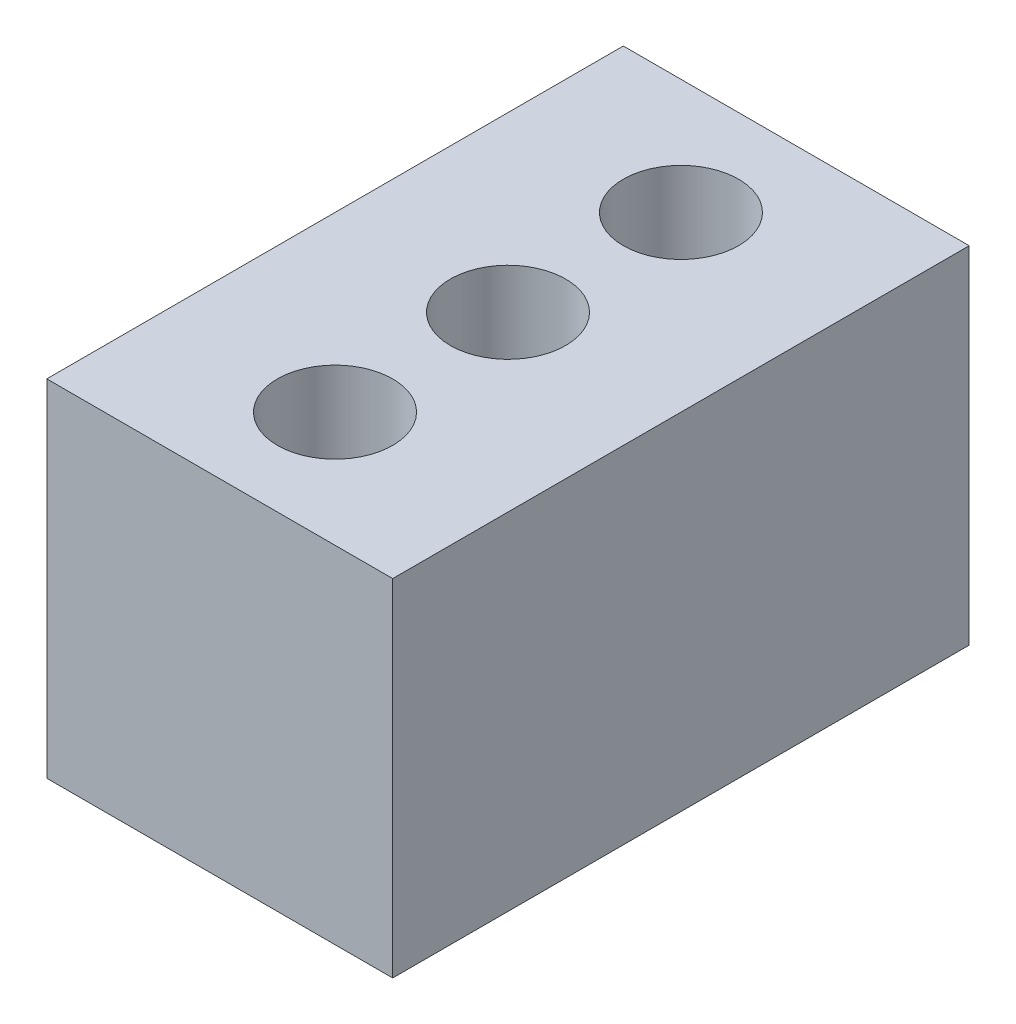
ISO-10303-21;
HEADER;
FILE_DESCRIPTION(('STEP AP214'),'2;1');
FILE_NAME('part.step','',(''),(''),'','','');
FILE_SCHEMA(('AUTOMOTIVE_DESIGN { 1 0 10303 214 1 1 1 1 }'));
ENDSEC;
DATA;
#1=APPLICATION_CONTEXT('core data for automotive mechanical design processes');
#2=APPLICATION_PROTOCOL_DEFINITION('international standard','automotive_design',2000,#1);
#3=PRODUCT_CONTEXT('',#1,'mechanical');
#4=PRODUCT('Part','Part','',(#3));
#5=PRODUCT_RELATED_PRODUCT_CATEGORY('part','',(#4));
#6=PRODUCT_DEFINITION_FORMATION('','',#4);
#7=PRODUCT_DEFINITION_CONTEXT('part definition',#1,'design');
#8=PRODUCT_DEFINITION('design','',#6,#7);
#9=PRODUCT_DEFINITION_SHAPE('','',#8);
#10=(LENGTH_UNIT() NAMED_UNIT(*) SI_UNIT(.MILLI.,.METRE.));
#11=(NAMED_UNIT(*) PLANE_ANGLE_UNIT() SI_UNIT($,.RADIAN.));
#12=(NAMED_UNIT(*) SI_UNIT($,.STERADIAN.) SOLID_ANGLE_UNIT());
#13=UNCERTAINTY_MEASURE_WITH_UNIT(LENGTH_MEASURE(1.E-05),#10,'distance_accuracy_value','');
#14=(GEOMETRIC_REPRESENTATION_CONTEXT(3) GLOBAL_UNCERTAINTY_ASSIGNED_CONTEXT((#13)) GLOBAL_UNIT_ASSIGNED_CONTEXT((#10,
#11,#12)) REPRESENTATION_CONTEXT('',''));
#15=CARTESIAN_POINT('',(0.,0.,0.));
#16=DIRECTION('',(0.,0.,1.));
#17=DIRECTION('',(1.,0.,0.));
#18=AXIS2_PLACEMENT_3D('',#15,#16,#17);
#19=CARTESIAN_POINT('',(0.,0.,50.));
#20=DIRECTION('',(1.,0.,0.));
#21=DIRECTION('',(0.,1.,0.));
#22=AXIS2_PLACEMENT_3D('',#19,#20,#21);
#23=PLANE('',#22);
#24=DIRECTION('',(0.,-1.,0.));
#25=VECTOR('',#24,1.);
#26=CARTESIAN_POINT('',(0.,0.,0.));
#27=LINE('',#26,#25);
#28=CARTESIAN_POINT('',(0.,0.,0.));
#29=VERTEX_POINT('',#28);
#30=CARTESIAN_POINT('',(0.,-30.,0.));
#31=VERTEX_POINT('',#30);
#32=EDGE_CURVE('E140',#29,#31,#27,.T.);
#33=ORIENTED_EDGE('',*,*,#32,.T.);
#34=DIRECTION('',(0.,0.,-1.));
#35=VECTOR('',#34,1.);
#36=CARTESIAN_POINT('',(0.,-30.,50.));
#37=LINE('',#36,#35);
#38=CARTESIAN_POINT('',(0.,-30.,50.));
#39=VERTEX_POINT('',#38);
#40=EDGE_CURVE('E159',#39,#31,#37,.T.);
#41=ORIENTED_EDGE('',*,*,#40,.F.);
#42=DIRECTION('',(0.,-1.,0.));
#43=VECTOR('',#42,1.);
#44=CARTESIAN_POINT('',(0.,0.,50.));
#45=LINE('',#44,#43);
#46=CARTESIAN_POINT('',(0.,0.,50.));
#47=VERTEX_POINT('',#46);
#48=EDGE_CURVE('E141',#47,#39,#45,.T.);
#49=ORIENTED_EDGE('',*,*,#48,.F.);
#50=DIRECTION('',(0.,0.,-1.));
#51=VECTOR('',#50,1.);
#52=CARTESIAN_POINT('',(0.,0.,50.));
#53=LINE('',#52,#51);
#54=EDGE_CURVE('E147',#47,#29,#53,.T.);
#55=ORIENTED_EDGE('',*,*,#54,.T.);
#56=EDGE_LOOP('',(#33,#41,#49,#55));
#57=FACE_BOUND('',#56,.T.);
#58=ADVANCED_FACE('F34',(#57),#23,.F.);
#59=CARTESIAN_POINT('',(0.,-30.,50.));
#60=DIRECTION('',(0.,1.,0.));
#61=DIRECTION('',(0.,0.,1.));
#62=AXIS2_PLACEMENT_3D('',#59,#60,#61);
#63=PLANE('',#62);
#64=CARTESIAN_POINT('',(15.,-30.,25.));
#65=DIRECTION('',(0.,1.,0.));
#66=DIRECTION('',(0.,0.,1.));
#67=AXIS2_PLACEMENT_3D('',#64,#65,#66);
#68=CIRCLE('',#67,4.99999999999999);
#69=CARTESIAN_POINT('',(15.,-30.,30.));
#70=VERTEX_POINT('',#69);
#71=EDGE_CURVE('E113',#70,#70,#68,.T.);
#72=ORIENTED_EDGE('',*,*,#71,.T.);
#73=EDGE_LOOP('',(#72));
#74=FACE_BOUND('',#73,.T.);
#75=CARTESIAN_POINT('',(15.,-30.,40.));
#76=DIRECTION('',(0.,1.,0.));
#77=DIRECTION('',(0.,0.,1.));
#78=AXIS2_PLACEMENT_3D('',#75,#76,#77);
#79=CIRCLE('',#78,4.99999999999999);
#80=CARTESIAN_POINT('',(15.,-30.,45.));
#81=VERTEX_POINT('',#80);
#82=EDGE_CURVE('E134',#81,#81,#79,.T.);
#83=ORIENTED_EDGE('',*,*,#82,.T.);
#84=EDGE_LOOP('',(#83));
#85=FACE_BOUND('',#84,.T.);
#86=DIRECTION('',(1.,0.,0.));
#87=VECTOR('',#86,1.);
#88=CARTESIAN_POINT('',(0.,-30.,0.));
#89=LINE('',#88,#87);
#90=CARTESIAN_POINT('',(30.,-30.,0.));
#91=VERTEX_POINT('',#90);
#92=EDGE_CURVE('E150',#31,#91,#89,.T.);
#93=ORIENTED_EDGE('',*,*,#92,.T.);
#94=DIRECTION('',(0.,0.,-1.));
#95=VECTOR('',#94,1.);
#96=CARTESIAN_POINT('',(30.,-30.,50.));
#97=LINE('',#96,#95);
#98=CARTESIAN_POINT('',(30.,-30.,50.));
#99=VERTEX_POINT('',#98);
#100=EDGE_CURVE('E157',#99,#91,#97,.T.);
#101=ORIENTED_EDGE('',*,*,#100,.F.);
#102=DIRECTION('',(1.,0.,0.));
#103=VECTOR('',#102,1.);
#104=CARTESIAN_POINT('',(0.,-30.,50.));
#105=LINE('',#104,#103);
#106=EDGE_CURVE('E83',#39,#99,#105,.T.);
#107=ORIENTED_EDGE('',*,*,#106,.F.);
#108=ORIENTED_EDGE('',*,*,#40,.T.);
#109=EDGE_LOOP('',(#93,#101,#107,#108));
#110=FACE_BOUND('',#109,.T.);
#111=CARTESIAN_POINT('',(15.,-30.,10.));
#112=DIRECTION('',(0.,1.,0.));
#113=DIRECTION('',(0.,0.,1.));
#114=AXIS2_PLACEMENT_3D('',#111,#112,#113);
#115=CIRCLE('',#114,4.99999999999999);
#116=CARTESIAN_POINT('',(15.,-30.,15.));
#117=VERTEX_POINT('',#116);
#118=EDGE_CURVE('E43',#117,#117,#115,.T.);
#119=ORIENTED_EDGE('',*,*,#118,.T.);
#120=EDGE_LOOP('',(#119));
#121=FACE_BOUND('',#120,.T.);
#122=ADVANCED_FACE('F163',(#74,#85,#110,#121),#63,.F.);
#123=CARTESIAN_POINT('',(30.,0.,50.));
#124=DIRECTION('',(-1.,0.,0.));
#125=DIRECTION('',(0.,-1.,0.));
#126=AXIS2_PLACEMENT_3D('',#123,#124,#125);
#127=PLANE('',#126);
#128=DIRECTION('',(0.,1.,0.));
#129=VECTOR('',#128,1.);
#130=CARTESIAN_POINT('',(30.,0.,0.));
#131=LINE('',#130,#129);
#132=CARTESIAN_POINT('',(30.,0.,0.));
#133=VERTEX_POINT('',#132);
#134=EDGE_CURVE('E69',#91,#133,#131,.T.);
#135=ORIENTED_EDGE('',*,*,#134,.T.);
#136=DIRECTION('',(0.,0.,-1.));
#137=VECTOR('',#136,1.);
#138=CARTESIAN_POINT('',(30.,0.,50.));
#139=LINE('',#138,#137);
#140=CARTESIAN_POINT('',(30.,0.,50.));
#141=VERTEX_POINT('',#140);
#142=EDGE_CURVE('E155',#141,#133,#139,.T.);
#143=ORIENTED_EDGE('',*,*,#142,.F.);
#144=DIRECTION('',(0.,1.,0.));
#145=VECTOR('',#144,1.);
#146=CARTESIAN_POINT('',(30.,0.,50.));
#147=LINE('',#146,#145);
#148=EDGE_CURVE('E144',#99,#141,#147,.T.);
#149=ORIENTED_EDGE('',*,*,#148,.F.);
#150=ORIENTED_EDGE('',*,*,#100,.T.);
#151=EDGE_LOOP('',(#135,#143,#149,#150));
#152=FACE_BOUND('',#151,.T.);
#153=ADVANCED_FACE('F172',(#152),#127,.F.);
#154=CARTESIAN_POINT('',(0.,0.,50.));
#155=DIRECTION('',(0.,-1.,0.));
#156=DIRECTION('',(0.,0.,-1.));
#157=AXIS2_PLACEMENT_3D('',#154,#155,#156);
#158=PLANE('',#157);
#159=CARTESIAN_POINT('',(15.,0.,25.));
#160=DIRECTION('',(0.,1.,0.));
#161=DIRECTION('',(0.,0.,1.));
#162=AXIS2_PLACEMENT_3D('',#159,#160,#161);
#163=CIRCLE('',#162,5.);
#164=CARTESIAN_POINT('',(15.,0.,30.));
#165=VERTEX_POINT('',#164);
#166=EDGE_CURVE('E107',#165,#165,#163,.T.);
#167=ORIENTED_EDGE('',*,*,#166,.F.);
#168=EDGE_LOOP('',(#167));
#169=FACE_BOUND('',#168,.T.);
#170=CARTESIAN_POINT('',(15.,0.,40.));
#171=DIRECTION('',(0.,1.,0.));
#172=DIRECTION('',(0.,0.,1.));
#173=AXIS2_PLACEMENT_3D('',#170,#171,#172);
#174=CIRCLE('',#173,5.);
#175=CARTESIAN_POINT('',(15.,0.,45.));
#176=VERTEX_POINT('',#175);
#177=EDGE_CURVE('E137',#176,#176,#174,.T.);
#178=ORIENTED_EDGE('',*,*,#177,.F.);
#179=EDGE_LOOP('',(#178));
#180=FACE_BOUND('',#179,.T.);
#181=DIRECTION('',(-1.,0.,0.));
#182=VECTOR('',#181,1.);
#183=CARTESIAN_POINT('',(0.,0.,0.));
#184=LINE('',#183,#182);
#185=EDGE_CURVE('E75',#133,#29,#184,.T.);
#186=ORIENTED_EDGE('',*,*,#185,.T.);
#187=ORIENTED_EDGE('',*,*,#54,.F.);
#188=DIRECTION('',(-1.,0.,0.));
#189=VECTOR('',#188,1.);
#190=CARTESIAN_POINT('',(0.,0.,50.));
#191=LINE('',#190,#189);
#192=EDGE_CURVE('E51',#141,#47,#191,.T.);
#193=ORIENTED_EDGE('',*,*,#192,.F.);
#194=ORIENTED_EDGE('',*,*,#142,.T.);
#195=EDGE_LOOP('',(#186,#187,#193,#194));
#196=FACE_BOUND('',#195,.T.);
#197=CARTESIAN_POINT('',(15.,0.,10.));
#198=DIRECTION('',(0.,1.,0.));
#199=DIRECTION('',(0.,0.,1.));
#200=AXIS2_PLACEMENT_3D('',#197,#198,#199);
#201=CIRCLE('',#200,5.);
#202=CARTESIAN_POINT('',(15.,0.,15.));
#203=VERTEX_POINT('',#202);
#204=EDGE_CURVE('E11',#203,#203,#201,.T.);
#205=ORIENTED_EDGE('',*,*,#204,.F.);
#206=EDGE_LOOP('',(#205));
#207=FACE_BOUND('',#206,.T.);
#208=ADVANCED_FACE('F169',(#169,#180,#196,#207),#158,.F.);
#209=CARTESIAN_POINT('',(0.,-30.,50.));
#210=DIRECTION('',(0.,0.,1.));
#211=DIRECTION('',(1.,0.,0.));
#212=AXIS2_PLACEMENT_3D('',#209,#210,#211);
#213=PLANE('',#212);
#214=ORIENTED_EDGE('',*,*,#48,.T.);
#215=ORIENTED_EDGE('',*,*,#106,.T.);
#216=ORIENTED_EDGE('',*,*,#148,.T.);
#217=ORIENTED_EDGE('',*,*,#192,.T.);
#218=EDGE_LOOP('',(#214,#215,#216,#217));
#219=FACE_BOUND('',#218,.T.);
#220=ADVANCED_FACE('F171',(#219),#213,.T.);
#221=CARTESIAN_POINT('',(0.,-30.,0.));
#222=DIRECTION('',(0.,0.,1.));
#223=DIRECTION('',(1.,0.,0.));
#224=AXIS2_PLACEMENT_3D('',#221,#222,#223);
#225=PLANE('',#224);
#226=CARTESIAN_POINT('',(24.,-24.,0.));
#227=DIRECTION('',(0.,0.,-1.));
#228=DIRECTION('',(-1.,0.,0.));
#229=AXIS2_PLACEMENT_3D('',#226,#227,#228);
#230=CIRCLE('',#229,2.5);
#231=CARTESIAN_POINT('',(21.5,-24.,0.));
#232=VERTEX_POINT('',#231);
#233=EDGE_CURVE('E106',#232,#232,#230,.T.);
#234=ORIENTED_EDGE('',*,*,#233,.F.);
#235=EDGE_LOOP('',(#234));
#236=FACE_BOUND('',#235,.T.);
#237=CARTESIAN_POINT('',(6.,-24.,0.));
#238=DIRECTION('',(0.,0.,-1.));
#239=DIRECTION('',(-1.,0.,0.));
#240=AXIS2_PLACEMENT_3D('',#237,#238,#239);
#241=CIRCLE('',#240,2.5);
#242=CARTESIAN_POINT('',(3.5,-24.,0.));
#243=VERTEX_POINT('',#242);
#244=EDGE_CURVE('E119',#243,#243,#241,.T.);
#245=ORIENTED_EDGE('',*,*,#244,.F.);
#246=EDGE_LOOP('',(#245));
#247=FACE_BOUND('',#246,.T.);
#248=CARTESIAN_POINT('',(24.,-6.,0.));
#249=DIRECTION('',(0.,0.,-1.));
#250=DIRECTION('',(-1.,0.,0.));
#251=AXIS2_PLACEMENT_3D('',#248,#249,#250);
#252=CIRCLE('',#251,2.5);
#253=CARTESIAN_POINT('',(21.5,-6.,0.));
#254=VERTEX_POINT('',#253);
#255=EDGE_CURVE('E122',#254,#254,#252,.T.);
#256=ORIENTED_EDGE('',*,*,#255,.F.);
#257=EDGE_LOOP('',(#256));
#258=FACE_BOUND('',#257,.T.);
#259=CARTESIAN_POINT('',(6.,-6.,0.));
#260=DIRECTION('',(0.,0.,-1.));
#261=DIRECTION('',(-1.,0.,0.));
#262=AXIS2_PLACEMENT_3D('',#259,#260,#261);
#263=CIRCLE('',#262,2.5);
#264=CARTESIAN_POINT('',(3.5,-6.,0.));
#265=VERTEX_POINT('',#264);
#266=EDGE_CURVE('E131',#265,#265,#263,.T.);
#267=ORIENTED_EDGE('',*,*,#266,.F.);
#268=EDGE_LOOP('',(#267));
#269=FACE_BOUND('',#268,.T.);
#270=ORIENTED_EDGE('',*,*,#32,.F.);
#271=ORIENTED_EDGE('',*,*,#185,.F.);
#272=ORIENTED_EDGE('',*,*,#134,.F.);
#273=ORIENTED_EDGE('',*,*,#92,.F.);
#274=EDGE_LOOP('',(#270,#271,#272,#273));
#275=FACE_BOUND('',#274,.T.);
#276=ADVANCED_FACE('F179',(#236,#247,#258,#269,#275),#225,.F.);
#277=CARTESIAN_POINT('',(15.,0.,40.));
#278=DIRECTION('',(0.,1.,0.));
#279=DIRECTION('',(0.,0.,1.));
#280=AXIS2_PLACEMENT_3D('',#277,#278,#279);
#281=CYLINDRICAL_SURFACE('',#280,5.);
#282=ORIENTED_EDGE('',*,*,#82,.F.);
#283=EDGE_LOOP('',(#282));
#284=FACE_BOUND('',#283,.T.);
#285=ORIENTED_EDGE('',*,*,#177,.T.);
#286=EDGE_LOOP('',(#285));
#287=FACE_BOUND('',#286,.T.);
#288=ADVANCED_FACE('F198',(#284,#287),#281,.F.);
#289=CARTESIAN_POINT('',(6.,-6.,0.));
#290=DIRECTION('',(0.,0.,-1.));
#291=DIRECTION('',(-1.,0.,0.));
#292=AXIS2_PLACEMENT_3D('',#289,#290,#291);
#293=CYLINDRICAL_SURFACE('',#292,2.5);
#294=CARTESIAN_POINT('',(6.,-6.,13.));
#295=DIRECTION('',(0.,0.,-1.));
#296=DIRECTION('',(-1.,0.,0.));
#297=AXIS2_PLACEMENT_3D('',#294,#295,#296);
#298=CIRCLE('',#297,2.5);
#299=CARTESIAN_POINT('',(3.5,-6.,13.));
#300=VERTEX_POINT('',#299);
#301=EDGE_CURVE('E128',#300,#300,#298,.T.);
#302=ORIENTED_EDGE('',*,*,#301,.F.);
#303=EDGE_LOOP('',(#302));
#304=FACE_BOUND('',#303,.T.);
#305=ORIENTED_EDGE('',*,*,#266,.T.);
#306=EDGE_LOOP('',(#305));
#307=FACE_BOUND('',#306,.T.);
#308=ADVANCED_FACE('F203',(#304,#307),#293,.F.);
#309=CARTESIAN_POINT('',(6.,-6.,13.));
#310=DIRECTION('',(0.,0.,-1.));
#311=DIRECTION('',(-1.,0.,0.));
#312=AXIS2_PLACEMENT_3D('',#309,#310,#311);
#313=CONICAL_SURFACE('',#312,2.5,1.02974425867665);
#314=CARTESIAN_POINT('',(5.99999999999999,-6.,14.5021515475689));
#315=VERTEX_POINT('',#314);
#316=VERTEX_LOOP('',#315);
#317=FACE_BOUND('',#316,.T.);
#318=ORIENTED_EDGE('',*,*,#301,.T.);
#319=EDGE_LOOP('',(#318));
#320=FACE_BOUND('',#319,.T.);
#321=ADVANCED_FACE('F211',(#317,#320),#313,.F.);
#322=CARTESIAN_POINT('',(24.,-6.,0.));
#323=DIRECTION('',(0.,0.,-1.));
#324=DIRECTION('',(-1.,0.,0.));
#325=AXIS2_PLACEMENT_3D('',#322,#323,#324);
#326=CYLINDRICAL_SURFACE('',#325,2.5);
#327=CARTESIAN_POINT('',(24.,-6.,13.));
#328=DIRECTION('',(0.,0.,-1.));
#329=DIRECTION('',(-1.,0.,0.));
#330=AXIS2_PLACEMENT_3D('',#327,#328,#329);
#331=CIRCLE('',#330,2.5);
#332=CARTESIAN_POINT('',(21.5,-6.,13.));
#333=VERTEX_POINT('',#332);
#334=EDGE_CURVE('E125',#333,#333,#331,.T.);
#335=ORIENTED_EDGE('',*,*,#334,.F.);
#336=EDGE_LOOP('',(#335));
#337=FACE_BOUND('',#336,.T.);
#338=ORIENTED_EDGE('',*,*,#255,.T.);
#339=EDGE_LOOP('',(#338));
#340=FACE_BOUND('',#339,.T.);
#341=ADVANCED_FACE('F215',(#337,#340),#326,.F.);
#342=CARTESIAN_POINT('',(24.,-6.,13.));
#343=DIRECTION('',(0.,0.,-1.));
#344=DIRECTION('',(-1.,0.,0.));
#345=AXIS2_PLACEMENT_3D('',#342,#343,#344);
#346=CONICAL_SURFACE('',#345,2.5,1.02974425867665);
#347=CARTESIAN_POINT('',(24.,-6.,14.5021515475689));
#348=VERTEX_POINT('',#347);
#349=VERTEX_LOOP('',#348);
#350=FACE_BOUND('',#349,.T.);
#351=ORIENTED_EDGE('',*,*,#334,.T.);
#352=EDGE_LOOP('',(#351));
#353=FACE_BOUND('',#352,.T.);
#354=ADVANCED_FACE('F217',(#350,#353),#346,.F.);
#355=CARTESIAN_POINT('',(6.,-24.,0.));
#356=DIRECTION('',(0.,0.,-1.));
#357=DIRECTION('',(-1.,0.,0.));
#358=AXIS2_PLACEMENT_3D('',#355,#356,#357);
#359=CYLINDRICAL_SURFACE('',#358,2.5);
#360=CARTESIAN_POINT('',(6.,-24.,13.));
#361=DIRECTION('',(0.,0.,-1.));
#362=DIRECTION('',(-1.,0.,0.));
#363=AXIS2_PLACEMENT_3D('',#360,#361,#362);
#364=CIRCLE('',#363,2.5);
#365=CARTESIAN_POINT('',(3.5,-24.,13.));
#366=VERTEX_POINT('',#365);
#367=EDGE_CURVE('E110',#366,#366,#364,.T.);
#368=ORIENTED_EDGE('',*,*,#367,.F.);
#369=EDGE_LOOP('',(#368));
#370=FACE_BOUND('',#369,.T.);
#371=ORIENTED_EDGE('',*,*,#244,.T.);
#372=EDGE_LOOP('',(#371));
#373=FACE_BOUND('',#372,.T.);
#374=ADVANCED_FACE('F221',(#370,#373),#359,.F.);
#375=CARTESIAN_POINT('',(6.,-24.,13.));
#376=DIRECTION('',(0.,0.,-1.));
#377=DIRECTION('',(-1.,0.,0.));
#378=AXIS2_PLACEMENT_3D('',#375,#376,#377);
#379=CONICAL_SURFACE('',#378,2.5,1.02974425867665);
#380=CARTESIAN_POINT('',(6.,-24.,14.5021515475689));
#381=VERTEX_POINT('',#380);
#382=VERTEX_LOOP('',#381);
#383=FACE_BOUND('',#382,.T.);
#384=ORIENTED_EDGE('',*,*,#367,.T.);
#385=EDGE_LOOP('',(#384));
#386=FACE_BOUND('',#385,.T.);
#387=ADVANCED_FACE('F227',(#383,#386),#379,.F.);
#388=CARTESIAN_POINT('',(24.,-24.,0.));
#389=DIRECTION('',(0.,0.,-1.));
#390=DIRECTION('',(-1.,0.,0.));
#391=AXIS2_PLACEMENT_3D('',#388,#389,#390);
#392=CYLINDRICAL_SURFACE('',#391,2.5);
#393=CARTESIAN_POINT('',(24.,-24.,13.));
#394=DIRECTION('',(0.,0.,-1.));
#395=DIRECTION('',(-1.,0.,0.));
#396=AXIS2_PLACEMENT_3D('',#393,#394,#395);
#397=CIRCLE('',#396,2.5);
#398=CARTESIAN_POINT('',(21.5,-24.,13.));
#399=VERTEX_POINT('',#398);
#400=EDGE_CURVE('E104',#399,#399,#397,.T.);
#401=ORIENTED_EDGE('',*,*,#400,.F.);
#402=EDGE_LOOP('',(#401));
#403=FACE_BOUND('',#402,.T.);
#404=ORIENTED_EDGE('',*,*,#233,.T.);
#405=EDGE_LOOP('',(#404));
#406=FACE_BOUND('',#405,.T.);
#407=ADVANCED_FACE('F100',(#403,#406),#392,.F.);
#408=CARTESIAN_POINT('',(24.,-24.,13.));
#409=DIRECTION('',(0.,0.,-1.));
#410=DIRECTION('',(-1.,0.,0.));
#411=AXIS2_PLACEMENT_3D('',#408,#409,#410);
#412=CONICAL_SURFACE('',#411,2.5,1.02974425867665);
#413=CARTESIAN_POINT('',(24.,-24.,14.5021515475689));
#414=VERTEX_POINT('',#413);
#415=VERTEX_LOOP('',#414);
#416=FACE_BOUND('',#415,.T.);
#417=ORIENTED_EDGE('',*,*,#400,.T.);
#418=EDGE_LOOP('',(#417));
#419=FACE_BOUND('',#418,.T.);
#420=ADVANCED_FACE('F96',(#416,#419),#412,.F.);
#421=CARTESIAN_POINT('',(15.,0.,25.));
#422=DIRECTION('',(0.,1.,0.));
#423=DIRECTION('',(0.,0.,1.));
#424=AXIS2_PLACEMENT_3D('',#421,#422,#423);
#425=CYLINDRICAL_SURFACE('',#424,5.);
#426=ORIENTED_EDGE('',*,*,#71,.F.);
#427=EDGE_LOOP('',(#426));
#428=FACE_BOUND('',#427,.T.);
#429=ORIENTED_EDGE('',*,*,#166,.T.);
#430=EDGE_LOOP('',(#429));
#431=FACE_BOUND('',#430,.T.);
#432=ADVANCED_FACE('F99',(#428,#431),#425,.F.);
#433=CARTESIAN_POINT('',(15.,0.,10.));
#434=DIRECTION('',(0.,1.,0.));
#435=DIRECTION('',(0.,0.,1.));
#436=AXIS2_PLACEMENT_3D('',#433,#434,#435);
#437=CYLINDRICAL_SURFACE('',#436,5.);
#438=ORIENTED_EDGE('',*,*,#118,.F.);
#439=EDGE_LOOP('',(#438));
#440=FACE_BOUND('',#439,.T.);
#441=ORIENTED_EDGE('',*,*,#204,.T.);
#442=EDGE_LOOP('',(#441));
#443=FACE_BOUND('',#442,.T.);
#444=ADVANCED_FACE('F36',(#440,#443),#437,.F.);
#445=CLOSED_SHELL('',(#58,#122,#153,#208,#220,#276,#288,#308,#321,#341,#354,#374,#387,#407,#420,
#432,#444));
#446=MANIFOLD_SOLID_BREP('B2',#445);
#447=ADVANCED_BREP_SHAPE_REPRESENTATION('',(#18,#446),#14);
#448=SHAPE_DEFINITION_REPRESENTATION(#9,#447);
ENDSEC;
END-ISO-10303-21;
